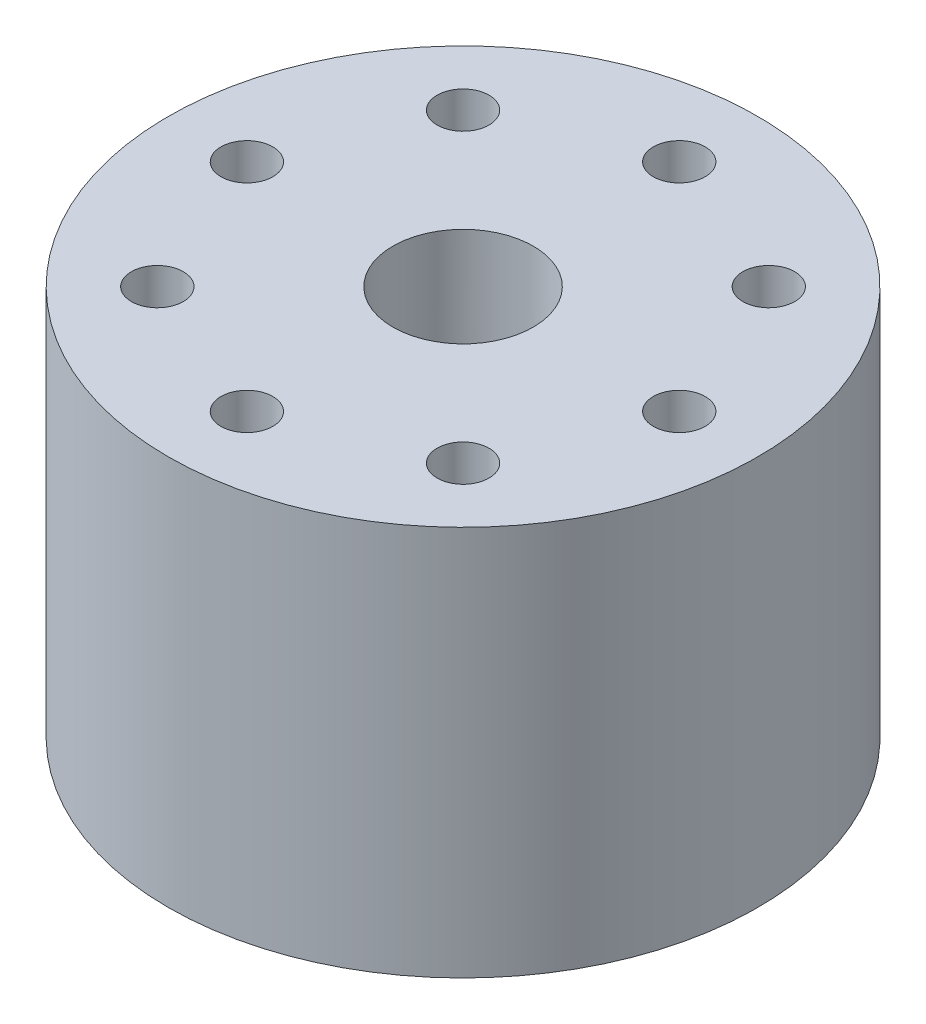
ISO-10303-21;
HEADER;
FILE_DESCRIPTION(('STEP AP214'),'2;1');
FILE_NAME('part.step','',(''),(''),'','','');
FILE_SCHEMA(('AUTOMOTIVE_DESIGN { 1 0 10303 214 1 1 1 1 }'));
ENDSEC;
DATA;
#1=APPLICATION_CONTEXT('core data for automotive mechanical design processes');
#2=APPLICATION_PROTOCOL_DEFINITION('international standard','automotive_design',2000,#1);
#3=PRODUCT_CONTEXT('',#1,'mechanical');
#4=PRODUCT('Part','Part','',(#3));
#5=PRODUCT_RELATED_PRODUCT_CATEGORY('part','',(#4));
#6=PRODUCT_DEFINITION_FORMATION('','',#4);
#7=PRODUCT_DEFINITION_CONTEXT('part definition',#1,'design');
#8=PRODUCT_DEFINITION('design','',#6,#7);
#9=PRODUCT_DEFINITION_SHAPE('','',#8);
#10=(LENGTH_UNIT() NAMED_UNIT(*) SI_UNIT(.MILLI.,.METRE.));
#11=(NAMED_UNIT(*) PLANE_ANGLE_UNIT() SI_UNIT($,.RADIAN.));
#12=(NAMED_UNIT(*) SI_UNIT($,.STERADIAN.) SOLID_ANGLE_UNIT());
#13=UNCERTAINTY_MEASURE_WITH_UNIT(LENGTH_MEASURE(1.E-05),#10,'distance_accuracy_value','');
#14=(GEOMETRIC_REPRESENTATION_CONTEXT(3) GLOBAL_UNCERTAINTY_ASSIGNED_CONTEXT((#13)) GLOBAL_UNIT_ASSIGNED_CONTEXT((#10,
#11,#12)) REPRESENTATION_CONTEXT('',''));
#15=CARTESIAN_POINT('',(0.,0.,0.));
#16=DIRECTION('',(0.,0.,1.));
#17=DIRECTION('',(1.,0.,0.));
#18=AXIS2_PLACEMENT_3D('',#15,#16,#17);
#19=CARTESIAN_POINT('',(0.,49.65,0.));
#20=DIRECTION('',(0.,-1.,0.));
#21=DIRECTION('',(0.,0.,-1.));
#22=AXIS2_PLACEMENT_3D('',#19,#20,#21);
#23=CYLINDRICAL_SURFACE('',#22,37.5);
#24=CARTESIAN_POINT('',(0.,49.65,0.));
#25=DIRECTION('',(0.,1.,0.));
#26=DIRECTION('',(0.,0.,1.));
#27=AXIS2_PLACEMENT_3D('',#24,#25,#26);
#28=CIRCLE('',#27,37.5);
#29=CARTESIAN_POINT('',(0.,49.65,37.5));
#30=VERTEX_POINT('',#29);
#31=EDGE_CURVE('E54',#30,#30,#28,.T.);
#32=ORIENTED_EDGE('',*,*,#31,.F.);
#33=EDGE_LOOP('',(#32));
#34=FACE_BOUND('',#33,.T.);
#35=CARTESIAN_POINT('',(0.,0.,0.));
#36=DIRECTION('',(0.,1.,0.));
#37=DIRECTION('',(0.,0.,1.));
#38=AXIS2_PLACEMENT_3D('',#35,#36,#37);
#39=CIRCLE('',#38,37.5);
#40=CARTESIAN_POINT('',(0.,0.,37.5));
#41=VERTEX_POINT('',#40);
#42=EDGE_CURVE('E58',#41,#41,#39,.T.);
#43=ORIENTED_EDGE('',*,*,#42,.T.);
#44=EDGE_LOOP('',(#43));
#45=FACE_BOUND('',#44,.T.);
#46=ADVANCED_FACE('F43',(#34,#45),#23,.T.);
#47=CARTESIAN_POINT('',(0.,49.65,0.));
#48=DIRECTION('',(0.,1.,0.));
#49=DIRECTION('',(0.,0.,1.));
#50=AXIS2_PLACEMENT_3D('',#47,#48,#49);
#51=PLANE('',#50);
#52=CARTESIAN_POINT('',(0.,49.65,27.5));
#53=DIRECTION('',(0.,1.,0.));
#54=DIRECTION('',(0.,0.,1.));
#55=AXIS2_PLACEMENT_3D('',#52,#53,#54);
#56=CIRCLE('',#55,3.3);
#57=CARTESIAN_POINT('',(0.,49.65,30.8));
#58=VERTEX_POINT('',#57);
#59=EDGE_CURVE('E263',#58,#58,#56,.T.);
#60=ORIENTED_EDGE('',*,*,#59,.F.);
#61=EDGE_LOOP('',(#60));
#62=FACE_BOUND('',#61,.T.);
#63=CARTESIAN_POINT('',(-19.4454364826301,49.65,19.44543648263));
#64=DIRECTION('',(0.,1.,0.));
#65=DIRECTION('',(0.,0.,1.));
#66=AXIS2_PLACEMENT_3D('',#63,#64,#65);
#67=CIRCLE('',#66,3.3);
#68=CARTESIAN_POINT('',(-19.4454364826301,49.65,22.74543648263));
#69=VERTEX_POINT('',#68);
#70=EDGE_CURVE('E268',#69,#69,#67,.T.);
#71=ORIENTED_EDGE('',*,*,#70,.F.);
#72=EDGE_LOOP('',(#71));
#73=FACE_BOUND('',#72,.T.);
#74=CARTESIAN_POINT('',(-27.5,49.65,0.));
#75=DIRECTION('',(0.,1.,0.));
#76=DIRECTION('',(0.,0.,1.));
#77=AXIS2_PLACEMENT_3D('',#74,#75,#76);
#78=CIRCLE('',#77,3.3);
#79=CARTESIAN_POINT('',(-27.5,49.65,3.2999999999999));
#80=VERTEX_POINT('',#79);
#81=EDGE_CURVE('E279',#80,#80,#78,.T.);
#82=ORIENTED_EDGE('',*,*,#81,.F.);
#83=EDGE_LOOP('',(#82));
#84=FACE_BOUND('',#83,.T.);
#85=CARTESIAN_POINT('',(-19.44543648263,49.65,-19.4454364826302));
#86=DIRECTION('',(0.,1.,0.));
#87=DIRECTION('',(0.,0.,1.));
#88=AXIS2_PLACEMENT_3D('',#85,#86,#87);
#89=CIRCLE('',#88,3.3);
#90=CARTESIAN_POINT('',(-19.44543648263,49.65,-16.1454364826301));
#91=VERTEX_POINT('',#90);
#92=EDGE_CURVE('E285',#91,#91,#89,.T.);
#93=ORIENTED_EDGE('',*,*,#92,.F.);
#94=EDGE_LOOP('',(#93));
#95=FACE_BOUND('',#94,.T.);
#96=CARTESIAN_POINT('',(1.92031473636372E-13,49.65,-27.5));
#97=DIRECTION('',(0.,1.,0.));
#98=DIRECTION('',(0.,0.,1.));
#99=AXIS2_PLACEMENT_3D('',#96,#97,#98);
#100=CIRCLE('',#99,3.3);
#101=CARTESIAN_POINT('',(1.92031473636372E-13,49.65,-24.2));
#102=VERTEX_POINT('',#101);
#103=EDGE_CURVE('E291',#102,#102,#100,.T.);
#104=ORIENTED_EDGE('',*,*,#103,.F.);
#105=EDGE_LOOP('',(#104));
#106=FACE_BOUND('',#105,.T.);
#107=CARTESIAN_POINT('',(19.4454364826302,49.65,-19.4454364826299));
#108=DIRECTION('',(0.,1.,0.));
#109=DIRECTION('',(0.,0.,1.));
#110=AXIS2_PLACEMENT_3D('',#107,#108,#109);
#111=CIRCLE('',#110,3.3);
#112=CARTESIAN_POINT('',(19.4454364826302,49.65,-16.1454364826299));
#113=VERTEX_POINT('',#112);
#114=EDGE_CURVE('E316',#113,#113,#111,.T.);
#115=ORIENTED_EDGE('',*,*,#114,.F.);
#116=EDGE_LOOP('',(#115));
#117=FACE_BOUND('',#116,.T.);
#118=CARTESIAN_POINT('',(27.5,49.65,2.88047210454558E-13));
#119=DIRECTION('',(0.,1.,0.));
#120=DIRECTION('',(0.,0.,1.));
#121=AXIS2_PLACEMENT_3D('',#118,#119,#120);
#122=CIRCLE('',#121,3.3);
#123=CARTESIAN_POINT('',(27.5,49.65,3.30000000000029));
#124=VERTEX_POINT('',#123);
#125=EDGE_CURVE('E323',#124,#124,#122,.T.);
#126=ORIENTED_EDGE('',*,*,#125,.F.);
#127=EDGE_LOOP('',(#126));
#128=FACE_BOUND('',#127,.T.);
#129=CARTESIAN_POINT('',(19.4454364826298,49.65,19.4454364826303));
#130=DIRECTION('',(0.,1.,0.));
#131=DIRECTION('',(0.,0.,1.));
#132=AXIS2_PLACEMENT_3D('',#129,#130,#131);
#133=CIRCLE('',#132,3.3);
#134=CARTESIAN_POINT('',(19.4454364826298,49.65,22.7454364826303));
#135=VERTEX_POINT('',#134);
#136=EDGE_CURVE('E264',#135,#135,#133,.T.);
#137=ORIENTED_EDGE('',*,*,#136,.F.);
#138=EDGE_LOOP('',(#137));
#139=FACE_BOUND('',#138,.T.);
#140=CARTESIAN_POINT('',(0.,49.65,0.));
#141=DIRECTION('',(0.,1.,0.));
#142=DIRECTION('',(0.,0.,1.));
#143=AXIS2_PLACEMENT_3D('',#140,#141,#142);
#144=CIRCLE('',#143,8.93);
#145=CARTESIAN_POINT('',(0.,49.65,8.93));
#146=VERTEX_POINT('',#145);
#147=EDGE_CURVE('E62',#146,#146,#144,.T.);
#148=ORIENTED_EDGE('',*,*,#147,.F.);
#149=EDGE_LOOP('',(#148));
#150=FACE_BOUND('',#149,.T.);
#151=ORIENTED_EDGE('',*,*,#31,.T.);
#152=EDGE_LOOP('',(#151));
#153=FACE_BOUND('',#152,.T.);
#154=ADVANCED_FACE('F104',(#62,#73,#84,#95,#106,#117,#128,#139,#150,#153),#51,.T.);
#155=CARTESIAN_POINT('',(0.,0.,0.));
#156=DIRECTION('',(0.,1.,0.));
#157=DIRECTION('',(0.,0.,1.));
#158=AXIS2_PLACEMENT_3D('',#155,#156,#157);
#159=PLANE('',#158);
#160=CARTESIAN_POINT('',(0.,0.,27.5));
#161=DIRECTION('',(0.,1.,0.));
#162=DIRECTION('',(0.,0.,1.));
#163=AXIS2_PLACEMENT_3D('',#160,#161,#162);
#164=CIRCLE('',#163,3.3);
#165=CARTESIAN_POINT('',(0.,0.,30.8));
#166=VERTEX_POINT('',#165);
#167=EDGE_CURVE('E260',#166,#166,#164,.T.);
#168=ORIENTED_EDGE('',*,*,#167,.T.);
#169=EDGE_LOOP('',(#168));
#170=FACE_BOUND('',#169,.T.);
#171=CARTESIAN_POINT('',(-19.4454364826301,0.,19.44543648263));
#172=DIRECTION('',(0.,1.,0.));
#173=DIRECTION('',(0.,0.,1.));
#174=AXIS2_PLACEMENT_3D('',#171,#172,#173);
#175=CIRCLE('',#174,3.3);
#176=CARTESIAN_POINT('',(-19.4454364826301,0.,22.74543648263));
#177=VERTEX_POINT('',#176);
#178=EDGE_CURVE('E276',#177,#177,#175,.T.);
#179=ORIENTED_EDGE('',*,*,#178,.T.);
#180=EDGE_LOOP('',(#179));
#181=FACE_BOUND('',#180,.T.);
#182=CARTESIAN_POINT('',(-27.5,0.,0.));
#183=DIRECTION('',(0.,1.,0.));
#184=DIRECTION('',(0.,0.,1.));
#185=AXIS2_PLACEMENT_3D('',#182,#183,#184);
#186=CIRCLE('',#185,3.3);
#187=CARTESIAN_POINT('',(-27.5,0.,3.2999999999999));
#188=VERTEX_POINT('',#187);
#189=EDGE_CURVE('E282',#188,#188,#186,.T.);
#190=ORIENTED_EDGE('',*,*,#189,.T.);
#191=EDGE_LOOP('',(#190));
#192=FACE_BOUND('',#191,.T.);
#193=CARTESIAN_POINT('',(-19.44543648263,0.,-19.4454364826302));
#194=DIRECTION('',(0.,1.,0.));
#195=DIRECTION('',(0.,0.,1.));
#196=AXIS2_PLACEMENT_3D('',#193,#194,#195);
#197=CIRCLE('',#196,3.3);
#198=CARTESIAN_POINT('',(-19.44543648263,0.,-16.1454364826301));
#199=VERTEX_POINT('',#198);
#200=EDGE_CURVE('E288',#199,#199,#197,.T.);
#201=ORIENTED_EDGE('',*,*,#200,.T.);
#202=EDGE_LOOP('',(#201));
#203=FACE_BOUND('',#202,.T.);
#204=CARTESIAN_POINT('',(1.92031473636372E-13,0.,-27.5));
#205=DIRECTION('',(0.,1.,0.));
#206=DIRECTION('',(0.,0.,1.));
#207=AXIS2_PLACEMENT_3D('',#204,#205,#206);
#208=CIRCLE('',#207,3.3);
#209=CARTESIAN_POINT('',(1.92031473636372E-13,0.,-24.2));
#210=VERTEX_POINT('',#209);
#211=EDGE_CURVE('E311',#210,#210,#208,.T.);
#212=ORIENTED_EDGE('',*,*,#211,.T.);
#213=EDGE_LOOP('',(#212));
#214=FACE_BOUND('',#213,.T.);
#215=CARTESIAN_POINT('',(19.4454364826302,0.,-19.4454364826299));
#216=DIRECTION('',(0.,1.,0.));
#217=DIRECTION('',(0.,0.,1.));
#218=AXIS2_PLACEMENT_3D('',#215,#216,#217);
#219=CIRCLE('',#218,3.3);
#220=CARTESIAN_POINT('',(19.4454364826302,0.,-16.1454364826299));
#221=VERTEX_POINT('',#220);
#222=EDGE_CURVE('E321',#221,#221,#219,.T.);
#223=ORIENTED_EDGE('',*,*,#222,.T.);
#224=EDGE_LOOP('',(#223));
#225=FACE_BOUND('',#224,.T.);
#226=CARTESIAN_POINT('',(27.5,0.,2.88047210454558E-13));
#227=DIRECTION('',(0.,1.,0.));
#228=DIRECTION('',(0.,0.,1.));
#229=AXIS2_PLACEMENT_3D('',#226,#227,#228);
#230=CIRCLE('',#229,3.3);
#231=CARTESIAN_POINT('',(27.5,0.,3.30000000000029));
#232=VERTEX_POINT('',#231);
#233=EDGE_CURVE('E271',#232,#232,#230,.T.);
#234=ORIENTED_EDGE('',*,*,#233,.T.);
#235=EDGE_LOOP('',(#234));
#236=FACE_BOUND('',#235,.T.);
#237=CARTESIAN_POINT('',(19.4454364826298,0.,19.4454364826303));
#238=DIRECTION('',(0.,1.,0.));
#239=DIRECTION('',(0.,0.,1.));
#240=AXIS2_PLACEMENT_3D('',#237,#238,#239);
#241=CIRCLE('',#240,3.3);
#242=CARTESIAN_POINT('',(19.4454364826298,0.,22.7454364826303));
#243=VERTEX_POINT('',#242);
#244=EDGE_CURVE('E267',#243,#243,#241,.T.);
#245=ORIENTED_EDGE('',*,*,#244,.T.);
#246=EDGE_LOOP('',(#245));
#247=FACE_BOUND('',#246,.T.);
#248=CARTESIAN_POINT('',(0.,0.,0.));
#249=DIRECTION('',(0.,-1.,0.));
#250=DIRECTION('',(0.,0.,-1.));
#251=AXIS2_PLACEMENT_3D('',#248,#249,#250);
#252=CIRCLE('',#251,15.);
#253=CARTESIAN_POINT('',(0.,0.,-15.));
#254=VERTEX_POINT('',#253);
#255=EDGE_CURVE('E67',#254,#254,#252,.T.);
#256=ORIENTED_EDGE('',*,*,#255,.F.);
#257=EDGE_LOOP('',(#256));
#258=FACE_BOUND('',#257,.T.);
#259=ORIENTED_EDGE('',*,*,#42,.F.);
#260=EDGE_LOOP('',(#259));
#261=FACE_BOUND('',#260,.T.);
#262=ADVANCED_FACE('F103',(#170,#181,#192,#203,#214,#225,#236,#247,#258,#261),#159,.F.);
#263=CARTESIAN_POINT('',(0.,26.65,0.));
#264=DIRECTION('',(0.,1.,0.));
#265=DIRECTION('',(0.,0.,1.));
#266=AXIS2_PLACEMENT_3D('',#263,#264,#265);
#267=CYLINDRICAL_SURFACE('',#266,8.93);
#268=CARTESIAN_POINT('',(0.,28.65,0.));
#269=DIRECTION('',(0.,1.,0.));
#270=DIRECTION('',(0.,0.,1.));
#271=AXIS2_PLACEMENT_3D('',#268,#269,#270);
#272=CIRCLE('',#271,8.93);
#273=CARTESIAN_POINT('',(0.,28.65,8.93));
#274=VERTEX_POINT('',#273);
#275=EDGE_CURVE('E50',#274,#274,#272,.F.);
#276=ORIENTED_EDGE('',*,*,#275,.T.);
#277=EDGE_LOOP('',(#276));
#278=FACE_BOUND('',#277,.T.);
#279=ORIENTED_EDGE('',*,*,#147,.T.);
#280=EDGE_LOOP('',(#279));
#281=FACE_BOUND('',#280,.T.);
#282=ADVANCED_FACE('F96',(#278,#281),#267,.F.);
#283=CARTESIAN_POINT('',(0.,3.15,0.));
#284=DIRECTION('',(0.,-1.,0.));
#285=DIRECTION('',(0.,0.,-1.));
#286=AXIS2_PLACEMENT_3D('',#283,#284,#285);
#287=PLANE('',#286);
#288=CARTESIAN_POINT('',(0.,3.15,0.));
#289=DIRECTION('',(0.,-1.,0.));
#290=DIRECTION('',(0.,0.,-1.));
#291=AXIS2_PLACEMENT_3D('',#288,#289,#290);
#292=CIRCLE('',#291,15.);
#293=CARTESIAN_POINT('',(0.,3.15,-15.));
#294=VERTEX_POINT('',#293);
#295=EDGE_CURVE('E66',#294,#294,#292,.T.);
#296=ORIENTED_EDGE('',*,*,#295,.T.);
#297=EDGE_LOOP('',(#296));
#298=FACE_BOUND('',#297,.T.);
#299=CARTESIAN_POINT('',(0.,3.15,0.));
#300=DIRECTION('',(0.,-1.,0.));
#301=DIRECTION('',(0.,0.,-1.));
#302=AXIS2_PLACEMENT_3D('',#299,#300,#301);
#303=CIRCLE('',#302,11.);
#304=CARTESIAN_POINT('',(0.,3.15,-11.));
#305=VERTEX_POINT('',#304);
#306=EDGE_CURVE('E70',#305,#305,#303,.T.);
#307=ORIENTED_EDGE('',*,*,#306,.F.);
#308=EDGE_LOOP('',(#307));
#309=FACE_BOUND('',#308,.T.);
#310=ADVANCED_FACE('F93',(#298,#309),#287,.T.);
#311=CARTESIAN_POINT('',(0.,3.15,0.));
#312=DIRECTION('',(0.,-1.,0.));
#313=DIRECTION('',(0.,0.,-1.));
#314=AXIS2_PLACEMENT_3D('',#311,#312,#313);
#315=CYLINDRICAL_SURFACE('',#314,15.);
#316=ORIENTED_EDGE('',*,*,#295,.F.);
#317=EDGE_LOOP('',(#316));
#318=FACE_BOUND('',#317,.T.);
#319=ORIENTED_EDGE('',*,*,#255,.T.);
#320=EDGE_LOOP('',(#319));
#321=FACE_BOUND('',#320,.T.);
#322=ADVANCED_FACE('F90',(#318,#321),#315,.F.);
#323=CARTESIAN_POINT('',(-11.,18.77,0.));
#324=CARTESIAN_POINT('',(-17.6,10.96,0.));
#325=CARTESIAN_POINT('',(-11.,3.15,0.));
#326=B_SPLINE_CURVE_WITH_KNOTS('',2,(#323,#324,#325),.UNSPECIFIED.,.F.,.F.,(3,3),(0.,1.),.UNSPECIFIED.);
#327=CARTESIAN_POINT('',(0.,3.15,0.));
#328=DIRECTION('',(0.,-1.,0.));
#329=AXIS1_PLACEMENT('',#327,#328);
#330=SURFACE_OF_REVOLUTION('',#326,#329);
#331=ORIENTED_EDGE('',*,*,#306,.T.);
#332=EDGE_LOOP('',(#331));
#333=FACE_BOUND('',#332,.T.);
#334=CARTESIAN_POINT('',(0.,18.77,0.));
#335=DIRECTION('',(0.,1.,0.));
#336=DIRECTION('',(-1.,0.,0.));
#337=AXIS2_PLACEMENT_3D('',#334,#335,#336);
#338=CIRCLE('',#337,11.);
#339=CARTESIAN_POINT('',(-11.,18.77,0.));
#340=VERTEX_POINT('',#339);
#341=EDGE_CURVE('E75',#340,#340,#338,.T.);
#342=ORIENTED_EDGE('',*,*,#341,.T.);
#343=EDGE_LOOP('',(#342));
#344=FACE_BOUND('',#343,.T.);
#345=ADVANCED_FACE('F85',(#333,#344),#330,.F.);
#346=CARTESIAN_POINT('',(0.,26.65,0.));
#347=DIRECTION('',(0.,1.,0.));
#348=DIRECTION('',(-1.,0.,0.));
#349=AXIS2_PLACEMENT_3D('',#346,#347,#348);
#350=CYLINDRICAL_SURFACE('',#349,11.);
#351=CARTESIAN_POINT('',(0.,26.9130637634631,0.));
#352=DIRECTION('',(0.,-1.,0.));
#353=DIRECTION('',(0.,0.,-1.));
#354=AXIS2_PLACEMENT_3D('',#351,#352,#353);
#355=CIRCLE('',#354,11.);
#356=CARTESIAN_POINT('',(0.,26.9130637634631,-11.));
#357=VERTEX_POINT('',#356);
#358=EDGE_CURVE('E11',#357,#357,#355,.F.);
#359=ORIENTED_EDGE('',*,*,#358,.T.);
#360=EDGE_LOOP('',(#359));
#361=FACE_BOUND('',#360,.T.);
#362=ORIENTED_EDGE('',*,*,#341,.F.);
#363=EDGE_LOOP('',(#362));
#364=FACE_BOUND('',#363,.T.);
#365=ADVANCED_FACE('F89',(#361,#364),#350,.F.);
#366=CARTESIAN_POINT('',(19.4454364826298,0.,19.4454364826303));
#367=DIRECTION('',(0.,1.,0.));
#368=DIRECTION('',(0.,0.,1.));
#369=AXIS2_PLACEMENT_3D('',#366,#367,#368);
#370=CYLINDRICAL_SURFACE('',#369,3.3);
#371=ORIENTED_EDGE('',*,*,#244,.F.);
#372=EDGE_LOOP('',(#371));
#373=FACE_BOUND('',#372,.T.);
#374=ORIENTED_EDGE('',*,*,#136,.T.);
#375=EDGE_LOOP('',(#374));
#376=FACE_BOUND('',#375,.T.);
#377=ADVANCED_FACE('F151',(#373,#376),#370,.F.);
#378=CARTESIAN_POINT('',(27.5,0.,2.88047210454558E-13));
#379=DIRECTION('',(0.,1.,0.));
#380=DIRECTION('',(0.,0.,1.));
#381=AXIS2_PLACEMENT_3D('',#378,#379,#380);
#382=CYLINDRICAL_SURFACE('',#381,3.3);
#383=ORIENTED_EDGE('',*,*,#125,.T.);
#384=EDGE_LOOP('',(#383));
#385=FACE_BOUND('',#384,.T.);
#386=ORIENTED_EDGE('',*,*,#233,.F.);
#387=EDGE_LOOP('',(#386));
#388=FACE_BOUND('',#387,.T.);
#389=ADVANCED_FACE('F157',(#385,#388),#382,.F.);
#390=CARTESIAN_POINT('',(19.4454364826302,0.,-19.4454364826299));
#391=DIRECTION('',(0.,1.,0.));
#392=DIRECTION('',(0.,0.,1.));
#393=AXIS2_PLACEMENT_3D('',#390,#391,#392);
#394=CYLINDRICAL_SURFACE('',#393,3.3);
#395=ORIENTED_EDGE('',*,*,#222,.F.);
#396=EDGE_LOOP('',(#395));
#397=FACE_BOUND('',#396,.T.);
#398=ORIENTED_EDGE('',*,*,#114,.T.);
#399=EDGE_LOOP('',(#398));
#400=FACE_BOUND('',#399,.T.);
#401=ADVANCED_FACE('F164',(#397,#400),#394,.F.);
#402=CARTESIAN_POINT('',(1.92031473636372E-13,0.,-27.5));
#403=DIRECTION('',(0.,1.,0.));
#404=DIRECTION('',(0.,0.,1.));
#405=AXIS2_PLACEMENT_3D('',#402,#403,#404);
#406=CYLINDRICAL_SURFACE('',#405,3.3);
#407=ORIENTED_EDGE('',*,*,#211,.F.);
#408=EDGE_LOOP('',(#407));
#409=FACE_BOUND('',#408,.T.);
#410=ORIENTED_EDGE('',*,*,#103,.T.);
#411=EDGE_LOOP('',(#410));
#412=FACE_BOUND('',#411,.T.);
#413=ADVANCED_FACE('F172',(#409,#412),#406,.F.);
#414=CARTESIAN_POINT('',(-19.44543648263,0.,-19.4454364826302));
#415=DIRECTION('',(0.,1.,0.));
#416=DIRECTION('',(0.,0.,1.));
#417=AXIS2_PLACEMENT_3D('',#414,#415,#416);
#418=CYLINDRICAL_SURFACE('',#417,3.3);
#419=ORIENTED_EDGE('',*,*,#200,.F.);
#420=EDGE_LOOP('',(#419));
#421=FACE_BOUND('',#420,.T.);
#422=ORIENTED_EDGE('',*,*,#92,.T.);
#423=EDGE_LOOP('',(#422));
#424=FACE_BOUND('',#423,.T.);
#425=ADVANCED_FACE('F180',(#421,#424),#418,.F.);
#426=CARTESIAN_POINT('',(-27.5,0.,0.));
#427=DIRECTION('',(0.,1.,0.));
#428=DIRECTION('',(0.,0.,1.));
#429=AXIS2_PLACEMENT_3D('',#426,#427,#428);
#430=CYLINDRICAL_SURFACE('',#429,3.3);
#431=ORIENTED_EDGE('',*,*,#189,.F.);
#432=EDGE_LOOP('',(#431));
#433=FACE_BOUND('',#432,.T.);
#434=ORIENTED_EDGE('',*,*,#81,.T.);
#435=EDGE_LOOP('',(#434));
#436=FACE_BOUND('',#435,.T.);
#437=ADVANCED_FACE('F188',(#433,#436),#430,.F.);
#438=CARTESIAN_POINT('',(-19.4454364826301,0.,19.44543648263));
#439=DIRECTION('',(0.,1.,0.));
#440=DIRECTION('',(0.,0.,1.));
#441=AXIS2_PLACEMENT_3D('',#438,#439,#440);
#442=CYLINDRICAL_SURFACE('',#441,3.3);
#443=ORIENTED_EDGE('',*,*,#178,.F.);
#444=EDGE_LOOP('',(#443));
#445=FACE_BOUND('',#444,.T.);
#446=ORIENTED_EDGE('',*,*,#70,.T.);
#447=EDGE_LOOP('',(#446));
#448=FACE_BOUND('',#447,.T.);
#449=ADVANCED_FACE('F196',(#445,#448),#442,.F.);
#450=CARTESIAN_POINT('',(0.,0.,27.5));
#451=DIRECTION('',(0.,1.,0.));
#452=DIRECTION('',(0.,0.,1.));
#453=AXIS2_PLACEMENT_3D('',#450,#451,#452);
#454=CYLINDRICAL_SURFACE('',#453,3.3);
#455=ORIENTED_EDGE('',*,*,#167,.F.);
#456=EDGE_LOOP('',(#455));
#457=FACE_BOUND('',#456,.T.);
#458=ORIENTED_EDGE('',*,*,#59,.T.);
#459=EDGE_LOOP('',(#458));
#460=FACE_BOUND('',#459,.T.);
#461=ADVANCED_FACE('F204',(#457,#460),#454,.F.);
#462=CARTESIAN_POINT('',(0.,26.65,0.));
#463=DIRECTION('',(0.,-1.,0.));
#464=DIRECTION('',(0.,0.,-1.));
#465=AXIS2_PLACEMENT_3D('',#462,#463,#464);
#466=CONICAL_SURFACE('',#465,11.3135071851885,0.87266462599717);
#467=ORIENTED_EDGE('',*,*,#275,.F.);
#468=EDGE_LOOP('',(#467));
#469=FACE_BOUND('',#468,.T.);
#470=ORIENTED_EDGE('',*,*,#358,.F.);
#471=EDGE_LOOP('',(#470));
#472=FACE_BOUND('',#471,.T.);
#473=ADVANCED_FACE('F45',(#469,#472),#466,.F.);
#474=CLOSED_SHELL('',(#46,#154,#262,#282,#310,#322,#345,#365,#377,#389,#401,#413,#425,#437,#449,
#461,#473));
#475=MANIFOLD_SOLID_BREP('B2',#474);
#476=ADVANCED_BREP_SHAPE_REPRESENTATION('',(#18,#475),#14);
#477=SHAPE_DEFINITION_REPRESENTATION(#9,#476);
ENDSEC;
END-ISO-10303-21;
